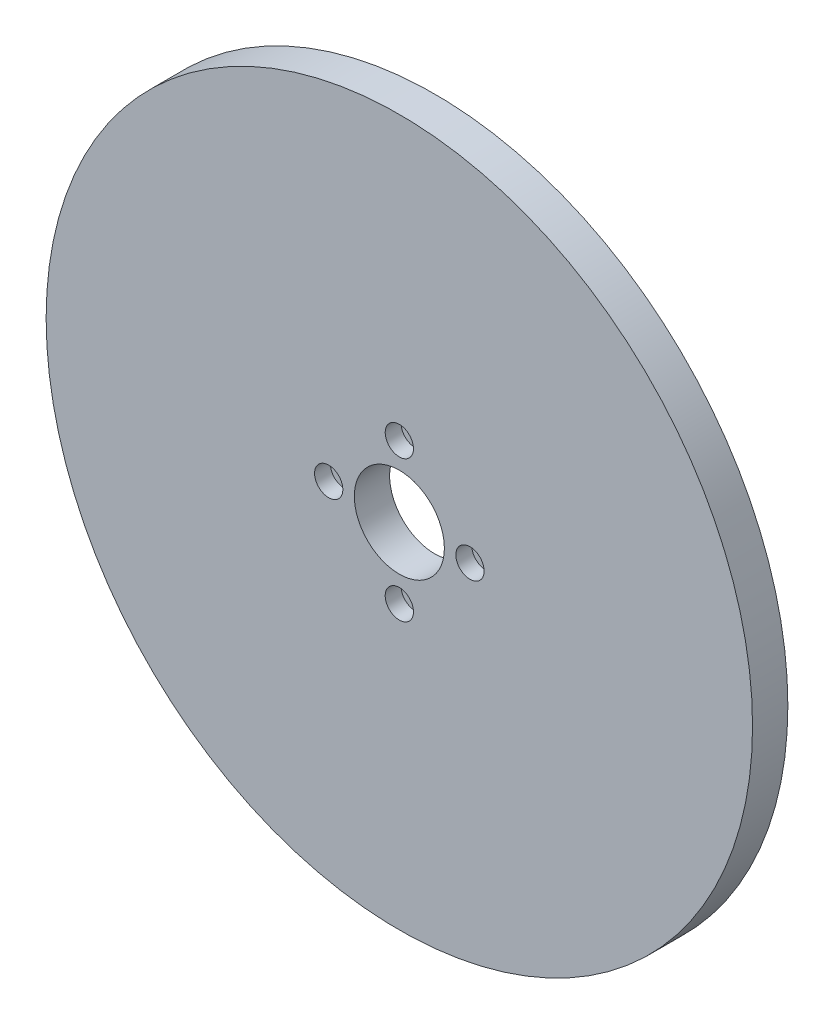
from build123d import *

# Parameters (mm, degrees)
SKETCH_1_R          = 100
SKETCH_1_R_2        = 12.75
SKETCH_1_R_3        = 2.25
EXTRUDE_1_DEPTH     = 10
SKETCH_2_R          = 4
CUT_EXTRUDE_1_DEPTH = 4.5


with BuildPart() as part:
    # Sketch 1 → Extrude 1 (new body)
    with BuildSketch(Plane.XY):
        Circle(SKETCH_1_R)
        Circle(SKETCH_1_R_2, mode=Mode.SUBTRACT)
        with Locations((20, 0)):
            Circle(SKETCH_1_R_3, mode=Mode.SUBTRACT)
        with Locations((0, -20)):
            Circle(SKETCH_1_R_3, mode=Mode.SUBTRACT)
        with Locations((-20, 0)):
            Circle(SKETCH_1_R_3, mode=Mode.SUBTRACT)
        with Locations((0, 20)):
            Circle(SKETCH_1_R_3, mode=Mode.SUBTRACT)
    extrude(amount=EXTRUDE_1_DEPTH)

    # Sketch 2 → Cut-Extrude 1 (cut)
    with BuildSketch(Plane.XY.offset(10)):
        with Locations((20, 0)):
            Circle(SKETCH_2_R)
        with Locations((0, -20)):
            Circle(SKETCH_2_R)
        with Locations((-20, 0)):
            Circle(SKETCH_2_R)
        with Locations((0, 20)):
            Circle(SKETCH_2_R)
    extrude(amount=-CUT_EXTRUDE_1_DEPTH, mode=Mode.SUBTRACT)


solid = part.part
